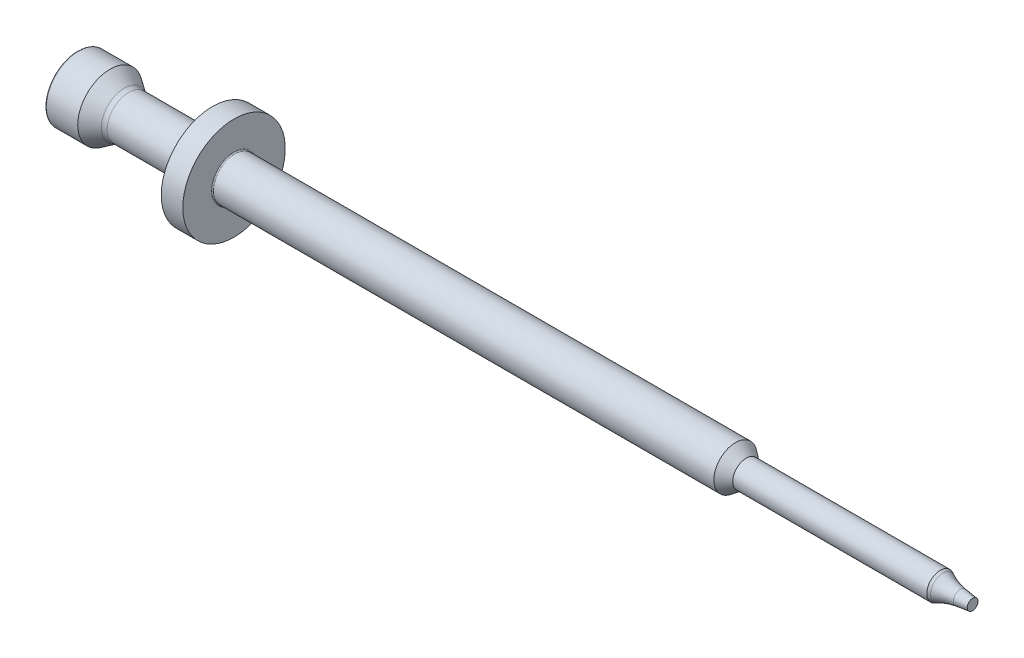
from build123d import *

# Parameters (mm, degrees)
FILLET1_R = 5
FILLET2_R = 0.1
FILLET3_R = 0.75
FILLET4_R = 0.75
FILLET5_R = 0.1


with BuildPart() as part:
    # Sketch1 → Revolve1 (revolve)
    with BuildSketch(Plane.XY, mode=Mode.PRIVATE) as revolve1_sk:
        Polygon((0, 0), (3, 0), (4.5, 0), (12.5, 0), (14.5, 0), (61, 0), (62, 0), (80, 0), (81, 0), (83, 0), (83, 0.5), (81, 0.75), (80, 1.25), (62, 1.25), (61, 2), (14.5, 2), (14.5, 4.75), (12.5, 4.75), (12.5, 2), (4.5, 2), (3, 3), (0, 3), align=None)
    revolve(revolve1_sk.sketch.rotate(Axis((0, 0, 0), (1, 0, 0)), 90), axis=Axis((0, 0, 0), (1, 0, 0)))

    # Fillet1
    fillet1_edges = [part.edges().sort_by_distance(p)[0] for p in [
        (81, 0, -0.75),
    ]]
    fillet(fillet1_edges, radius=FILLET1_R)

    # Fillet2
    fillet2_edges = [part.edges().sort_by_distance(p)[0] for p in [
        (14.5, 0, -2),
    ]]
    fillet(fillet2_edges, radius=FILLET2_R)

    # Fillet3
    fillet3_edges = [part.edges().sort_by_distance(p)[0] for p in [
        (12.5, 0, -2),
    ]]
    fillet(fillet3_edges, radius=FILLET3_R)

    # Fillet4
    fillet4_edges = [part.edges().sort_by_distance(p)[0] for p in [
        (4.5, 0, -2),
    ]]
    fillet(fillet4_edges, radius=FILLET4_R)

    # Fillet5
    fillet5_edges = [part.edges().sort_by_distance(p)[0] for p in [
        (0, 0, -3),
    ]]
    fillet(fillet5_edges, radius=FILLET5_R)


solid = part.part
